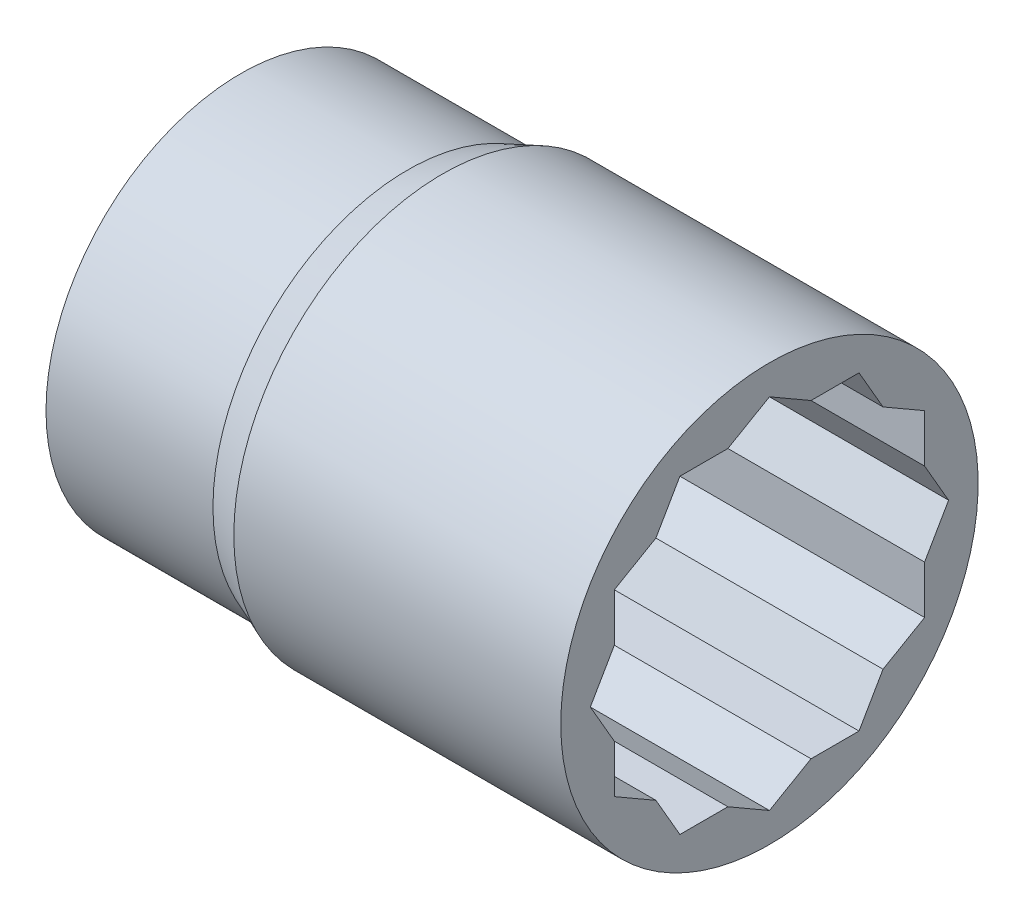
from build123d import *

# Parameters (mm, degrees)
ESQUISSE2_W             = 12
ESQUISSE2_H             = 12
ENL_V_MAT_EXTRU_1_DEPTH = 44.520110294
ENL_V_MAT_EXTRU_2_DEPTH = 20


with BuildPart() as part:
    # Esquisse1 → R_volution1 (revolve)
    with BuildSketch(Plane.XY, mode=Mode.PRIVATE) as r_volution1_sk:
        Polygon((0, 0), (0, 14), (12, 14), (14.5, 15), (38, 15), (38, 0), align=None)
    revolve(r_volution1_sk.sketch.rotate(Axis((0, 0, 0), (1, 0, 0)), 90), axis=Axis((0, 0, 0), (1, 0, 0)))

    # Esquisse2 → Enl_v. mat.-Extru.1 (cut, through all)
    with BuildSketch(Plane.ZY):
        Rectangle(ESQUISSE2_W, ESQUISSE2_H)
    extrude(amount=-ENL_V_MAT_EXTRU_1_DEPTH, mode=Mode.SUBTRACT)

    # Esquisse3 → Enl_v. mat.-Extru.2 (cut)
    with BuildSketch(Plane(origin=(38, 0, 0), x_dir=(0, 0, -1), z_dir=(1, 0, 0))):
        Polygon((11.15, 6.437455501), (8.162366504, 8.162366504), (6.437455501, 11.15), (2.987633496, 11.15), (0, 12.874911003), (-2.987633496, 11.15), (-6.437455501, 11.15), (-8.162366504, 8.162366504), (-11.15, 6.437455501), (-11.15, 2.987633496), (-12.874911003, 0), (-11.15, -2.987633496), (-11.15, -6.437455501), (-8.162366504, -8.162366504), (-6.437455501, -11.15), (-2.987633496, -11.15), (0, -12.874911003), (2.987633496, -11.15), (6.437455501, -11.15), (8.162366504, -8.162366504), (11.15, -6.437455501), (11.15, -2.987633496), (12.874911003, 0), (11.15, 2.987633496), align=None)
    extrude(amount=-ENL_V_MAT_EXTRU_2_DEPTH, mode=Mode.SUBTRACT)


solid = part.part
